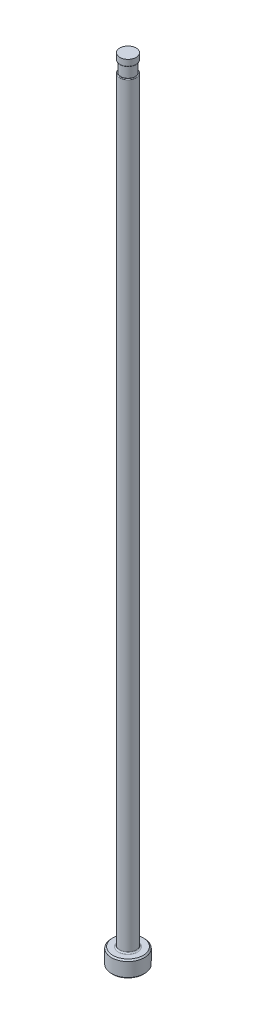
ISO-10303-21;
HEADER;
FILE_DESCRIPTION(('STEP AP214'),'2;1');
FILE_NAME('part.step','',(''),(''),'','','');
FILE_SCHEMA(('AUTOMOTIVE_DESIGN { 1 0 10303 214 1 1 1 1 }'));
ENDSEC;
DATA;
#1=APPLICATION_CONTEXT('core data for automotive mechanical design processes');
#2=APPLICATION_PROTOCOL_DEFINITION('international standard','automotive_design',2000,#1);
#3=PRODUCT_CONTEXT('',#1,'mechanical');
#4=PRODUCT('Part','Part','',(#3));
#5=PRODUCT_RELATED_PRODUCT_CATEGORY('part','',(#4));
#6=PRODUCT_DEFINITION_FORMATION('','',#4);
#7=PRODUCT_DEFINITION_CONTEXT('part definition',#1,'design');
#8=PRODUCT_DEFINITION('design','',#6,#7);
#9=PRODUCT_DEFINITION_SHAPE('','',#8);
#10=(LENGTH_UNIT() NAMED_UNIT(*) SI_UNIT(.MILLI.,.METRE.));
#11=(NAMED_UNIT(*) PLANE_ANGLE_UNIT() SI_UNIT($,.RADIAN.));
#12=(NAMED_UNIT(*) SI_UNIT($,.STERADIAN.) SOLID_ANGLE_UNIT());
#13=UNCERTAINTY_MEASURE_WITH_UNIT(LENGTH_MEASURE(1.E-05),#10,'distance_accuracy_value','');
#14=(GEOMETRIC_REPRESENTATION_CONTEXT(3) GLOBAL_UNCERTAINTY_ASSIGNED_CONTEXT((#13)) GLOBAL_UNIT_ASSIGNED_CONTEXT((#10,
#11,#12)) REPRESENTATION_CONTEXT('',''));
#15=CARTESIAN_POINT('',(0.,0.,0.));
#16=DIRECTION('',(0.,0.,1.));
#17=DIRECTION('',(1.,0.,0.));
#18=AXIS2_PLACEMENT_3D('',#15,#16,#17);
#19=CARTESIAN_POINT('',(-1.58749999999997,151.13,0.));
#20=DIRECTION('',(0.,1.,0.));
#21=DIRECTION('',(0.,0.,1.));
#22=AXIS2_PLACEMENT_3D('',#19,#20,#21);
#23=PLANE('',#22);
#24=CARTESIAN_POINT('',(0.,151.13,0.));
#25=DIRECTION('',(0.,1.,0.));
#26=DIRECTION('',(0.,0.,1.));
#27=AXIS2_PLACEMENT_3D('',#24,#25,#26);
#28=CIRCLE('',#27,1.44779999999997);
#29=CARTESIAN_POINT('',(0.,151.13,1.44779999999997));
#30=VERTEX_POINT('',#29);
#31=EDGE_CURVE('E11',#30,#30,#28,.F.);
#32=ORIENTED_EDGE('',*,*,#31,.T.);
#33=EDGE_LOOP('',(#32));
#34=FACE_BOUND('',#33,.T.);
#35=CARTESIAN_POINT('',(0.,151.13,0.));
#36=DIRECTION('',(0.,1.,0.));
#37=DIRECTION('',(0.,0.,1.));
#38=AXIS2_PLACEMENT_3D('',#35,#36,#37);
#39=CIRCLE('',#38,1.38429999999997);
#40=CARTESIAN_POINT('',(0.,151.13,1.38429999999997));
#41=VERTEX_POINT('',#40);
#42=EDGE_CURVE('E78',#41,#41,#39,.T.);
#43=ORIENTED_EDGE('',*,*,#42,.T.);
#44=EDGE_LOOP('',(#43));
#45=FACE_BOUND('',#44,.T.);
#46=ADVANCED_FACE('F36',(#34,#45),#23,.F.);
#47=CARTESIAN_POINT('',(0.,259.958771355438,0.));
#48=DIRECTION('',(0.,1.,0.));
#49=DIRECTION('',(0.,0.,1.));
#50=AXIS2_PLACEMENT_3D('',#47,#48,#49);
#51=CYLINDRICAL_SURFACE('',#50,1.58749999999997);
#52=DIRECTION('',(0.,1.,0.));
#53=VECTOR('',#52,1.);
#54=CARTESIAN_POINT('',(-1.38429999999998,259.958771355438,-0.777090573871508));
#55=LINE('',#54,#53);
#56=CARTESIAN_POINT('',(-1.38429999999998,148.971,-0.777090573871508));
#57=VERTEX_POINT('',#56);
#58=CARTESIAN_POINT('',(-1.38429999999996,86.614,-0.777090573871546));
#59=VERTEX_POINT('',#58);
#60=EDGE_CURVE('E73',#57,#59,#55,.F.);
#61=ORIENTED_EDGE('',*,*,#60,.F.);
#62=CARTESIAN_POINT('',(0.,148.971,0.));
#63=DIRECTION('',(0.,-1.,0.));
#64=DIRECTION('',(0.,0.,-1.));
#65=AXIS2_PLACEMENT_3D('',#62,#63,#64);
#66=CIRCLE('',#65,1.58749999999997);
#67=CARTESIAN_POINT('',(-1.38429999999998,148.971,0.777090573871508));
#68=VERTEX_POINT('',#67);
#69=EDGE_CURVE('E51',#57,#68,#66,.T.);
#70=ORIENTED_EDGE('',*,*,#69,.T.);
#71=DIRECTION('',(0.,1.,0.));
#72=VECTOR('',#71,1.);
#73=CARTESIAN_POINT('',(-1.38429999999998,259.958771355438,0.777090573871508));
#74=LINE('',#73,#72);
#75=CARTESIAN_POINT('',(-1.38429999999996,86.614,0.777090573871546));
#76=VERTEX_POINT('',#75);
#77=EDGE_CURVE('E84',#76,#68,#74,.T.);
#78=ORIENTED_EDGE('',*,*,#77,.F.);
#79=CARTESIAN_POINT('',(-1.38429999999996,86.614,-0.777090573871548));
#80=CARTESIAN_POINT('',(-1.38429609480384,86.5767272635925,-0.777082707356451));
#81=CARTESIAN_POINT('',(-1.38495631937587,86.5394527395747,-0.775921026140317));
#82=CARTESIAN_POINT('',(-1.38757712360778,86.4650763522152,-0.771232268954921));
#83=CARTESIAN_POINT('',(-1.38953849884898,86.4279746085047,-0.767703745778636));
#84=CARTESIAN_POINT('',(-1.39477495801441,86.3535790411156,-0.758148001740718));
#85=CARTESIAN_POINT('',(-1.39807044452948,86.316291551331,-0.752081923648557));
#86=CARTESIAN_POINT('',(-1.40590319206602,86.2423849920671,-0.737333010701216));
#87=CARTESIAN_POINT('',(-1.41044024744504,86.2057658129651,-0.728650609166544));
#88=CARTESIAN_POINT('',(-1.42582382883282,86.096986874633,-0.698367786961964));
#89=CARTESIAN_POINT('',(-1.43842338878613,86.0261687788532,-0.672562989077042));
#90=CARTESIAN_POINT('',(-1.46680838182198,85.8916572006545,-0.608160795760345));
#91=CARTESIAN_POINT('',(-1.48256997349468,85.8279156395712,-0.569657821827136));
#92=CARTESIAN_POINT('',(-1.50737283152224,85.7379333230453,-0.498685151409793));
#93=CARTESIAN_POINT('',(-1.51626333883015,85.7076802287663,-0.471232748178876));
#94=CARTESIAN_POINT('',(-1.53347485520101,85.6517865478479,-0.411785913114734));
#95=CARTESIAN_POINT('',(-1.54179640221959,85.6261415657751,-0.379795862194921));
#96=CARTESIAN_POINT('',(-1.55583338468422,85.5843277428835,-0.316871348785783));
#97=CARTESIAN_POINT('',(-1.56175286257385,85.5673042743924,-0.28655344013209));
#98=CARTESIAN_POINT('',(-1.57203785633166,85.53830135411,-0.223329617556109));
#99=CARTESIAN_POINT('',(-1.57640406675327,85.5263196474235,-0.190424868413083));
#100=CARTESIAN_POINT('',(-1.58312350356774,85.5080632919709,-0.122641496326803));
#101=CARTESIAN_POINT('',(-1.58546485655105,85.5018222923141,-0.0877524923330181));
#102=CARTESIAN_POINT('',(-1.58779523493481,85.4956097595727,-0.0173445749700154));
#103=CARTESIAN_POINT('',(-1.58778524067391,85.4956356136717,0.0181740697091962));
#104=CARTESIAN_POINT('',(-1.58553927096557,85.5016246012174,0.0850166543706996));
#105=CARTESIAN_POINT('',(-1.58352667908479,85.5069919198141,0.116403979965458));
#106=CARTESIAN_POINT('',(-1.57781194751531,85.5224774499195,0.177812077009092));
#107=CARTESIAN_POINT('',(-1.57410971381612,85.5325959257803,0.20783277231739));
#108=CARTESIAN_POINT('',(-1.56522233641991,85.5574483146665,0.266740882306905));
#109=CARTESIAN_POINT('',(-1.55999564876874,85.5723128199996,0.295566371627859));
#110=CARTESIAN_POINT('',(-1.54854541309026,85.6058843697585,0.350651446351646));
#111=CARTESIAN_POINT('',(-1.54232137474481,85.6245933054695,0.376909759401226));
#112=CARTESIAN_POINT('',(-1.52624085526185,85.674770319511,0.438380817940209));
#113=CARTESIAN_POINT('',(-1.51605337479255,85.7080994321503,0.471992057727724));
#114=CARTESIAN_POINT('',(-1.49561074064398,85.7798332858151,0.533246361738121));
#115=CARTESIAN_POINT('',(-1.48535548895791,85.8182487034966,0.560876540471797));
#116=CARTESIAN_POINT('',(-1.46194815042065,85.9138127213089,0.61985698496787));
#117=CARTESIAN_POINT('',(-1.44915247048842,85.9725828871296,0.648714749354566));
#118=CARTESIAN_POINT('',(-1.42648713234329,86.0944065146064,0.697138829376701));
#119=CARTESIAN_POINT('',(-1.41662511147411,86.1574706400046,0.716680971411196));
#120=CARTESIAN_POINT('',(-1.40064446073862,86.2858415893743,0.747428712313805));
#121=CARTESIAN_POINT('',(-1.39451475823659,86.3511411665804,0.758658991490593));
#122=CARTESIAN_POINT('',(-1.38838804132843,86.449622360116,0.769772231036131));
#123=CARTESIAN_POINT('',(-1.38685717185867,86.4824222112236,0.772521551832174));
#124=CARTESIAN_POINT('',(-1.38481284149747,86.5481449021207,0.776178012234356));
#125=CARTESIAN_POINT('',(-1.38429902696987,86.5810676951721,0.777085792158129));
#126=CARTESIAN_POINT('',(-1.38429999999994,86.6139999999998,0.777090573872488));
#127=B_SPLINE_CURVE_WITH_KNOTS('',3,(#79,#80,#81,#82,#83,#84,#85,#86,#87,#88,#89,#90,#91,#92,
#93,#94,#95,#96,#97,#98,#99,#100,#101,#102,#103,#104,#105,#106,#107,#108,#109,#110,#111,#112,
#113,#114,#115,#116,#117,#118,#119,#120,#121,#122,#123,#124,#125,#126),.UNSPECIFIED.,.F.,.F.,(4,
2,2,2,2,2,2,2,2,2,2,2,2,2,2,2,2,2,2,2,2,2,2,4),(0.,0.111796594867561,0.22366161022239,
0.33730621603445,0.450932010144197,0.678971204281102,0.905351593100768,1.03037322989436,
1.1552749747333,1.26065408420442,1.36598601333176,1.47193148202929,1.57783277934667,
1.67311136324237,1.76839524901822,1.86656705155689,1.96478726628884,2.10923104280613,
2.25398297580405,2.45303424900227,2.65259927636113,2.85156933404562,2.95036438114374,
3.04912507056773),.UNSPECIFIED.);
#128=EDGE_CURVE('E81',#59,#76,#127,.T.);
#129=ORIENTED_EDGE('',*,*,#128,.F.);
#130=EDGE_LOOP('',(#61,#70,#78,#129));
#131=FACE_BOUND('',#130,.T.);
#132=CARTESIAN_POINT('',(0.,3.42900000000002,0.));
#133=DIRECTION('',(0.,1.,0.));
#134=DIRECTION('',(0.,0.,1.));
#135=AXIS2_PLACEMENT_3D('',#132,#133,#134);
#136=CIRCLE('',#135,1.58749999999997);
#137=CARTESIAN_POINT('',(0.,3.42900000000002,1.58749999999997));
#138=VERTEX_POINT('',#137);
#139=EDGE_CURVE('E116',#138,#138,#136,.T.);
#140=ORIENTED_EDGE('',*,*,#139,.T.);
#141=EDGE_LOOP('',(#140));
#142=FACE_BOUND('',#141,.T.);
#143=ADVANCED_FACE('F82',(#131,#142),#51,.T.);
#144=CARTESIAN_POINT('',(0.,0.,0.));
#145=DIRECTION('',(0.,-1.,0.));
#146=DIRECTION('',(0.,0.,-1.));
#147=AXIS2_PLACEMENT_3D('',#144,#145,#146);
#148=PLANE('',#147);
#149=CARTESIAN_POINT('',(0.,0.,0.));
#150=DIRECTION('',(0.,-1.,0.));
#151=DIRECTION('',(0.,0.,-1.));
#152=AXIS2_PLACEMENT_3D('',#149,#150,#151);
#153=CIRCLE('',#152,2.92099999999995);
#154=CARTESIAN_POINT('',(0.,0.,-2.92099999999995));
#155=VERTEX_POINT('',#154);
#156=EDGE_CURVE('E113',#155,#155,#153,.T.);
#157=ORIENTED_EDGE('',*,*,#156,.T.);
#158=EDGE_LOOP('',(#157));
#159=FACE_BOUND('',#158,.T.);
#160=ADVANCED_FACE('F192',(#159),#148,.T.);
#161=CARTESIAN_POINT('',(0.,259.958771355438,0.));
#162=DIRECTION('',(0.,1.,0.));
#163=DIRECTION('',(0.,0.,1.));
#164=AXIS2_PLACEMENT_3D('',#161,#162,#163);
#165=CYLINDRICAL_SURFACE('',#164,3.17499999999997);
#166=CARTESIAN_POINT('',(0.,2.92100000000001,0.));
#167=DIRECTION('',(0.,1.,0.));
#168=DIRECTION('',(0.,0.,1.));
#169=AXIS2_PLACEMENT_3D('',#166,#167,#168);
#170=CIRCLE('',#169,3.17499999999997);
#171=CARTESIAN_POINT('',(0.,2.92100000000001,3.17499999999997));
#172=VERTEX_POINT('',#171);
#173=EDGE_CURVE('E110',#172,#172,#170,.F.);
#174=ORIENTED_EDGE('',*,*,#173,.T.);
#175=EDGE_LOOP('',(#174));
#176=FACE_BOUND('',#175,.T.);
#177=CARTESIAN_POINT('',(0.,0.254000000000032,0.));
#178=DIRECTION('',(0.,-1.,0.));
#179=DIRECTION('',(0.,0.,-1.));
#180=AXIS2_PLACEMENT_3D('',#177,#178,#179);
#181=CIRCLE('',#180,3.17499999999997);
#182=CARTESIAN_POINT('',(0.,0.254000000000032,-3.17499999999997));
#183=VERTEX_POINT('',#182);
#184=EDGE_CURVE('E107',#183,#183,#181,.F.);
#185=ORIENTED_EDGE('',*,*,#184,.T.);
#186=EDGE_LOOP('',(#185));
#187=FACE_BOUND('',#186,.T.);
#188=ADVANCED_FACE('F195',(#176,#187),#165,.T.);
#189=CARTESIAN_POINT('',(-3.17499999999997,3.175,0.));
#190=DIRECTION('',(0.,1.,0.));
#191=DIRECTION('',(0.,0.,1.));
#192=AXIS2_PLACEMENT_3D('',#189,#190,#191);
#193=PLANE('',#192);
#194=CARTESIAN_POINT('',(0.,3.175,0.));
#195=DIRECTION('',(0.,1.,0.));
#196=DIRECTION('',(0.,0.,1.));
#197=AXIS2_PLACEMENT_3D('',#194,#195,#196);
#198=CIRCLE('',#197,1.84149999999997);
#199=CARTESIAN_POINT('',(0.,3.175,1.84149999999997));
#200=VERTEX_POINT('',#199);
#201=EDGE_CURVE('E87',#200,#200,#198,.F.);
#202=ORIENTED_EDGE('',*,*,#201,.T.);
#203=EDGE_LOOP('',(#202));
#204=FACE_BOUND('',#203,.T.);
#205=CARTESIAN_POINT('',(0.,3.175,0.));
#206=DIRECTION('',(0.,1.,0.));
#207=DIRECTION('',(0.,0.,1.));
#208=AXIS2_PLACEMENT_3D('',#205,#206,#207);
#209=CIRCLE('',#208,2.92099999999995);
#210=CARTESIAN_POINT('',(0.,3.175,2.92099999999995));
#211=VERTEX_POINT('',#210);
#212=EDGE_CURVE('E104',#211,#211,#209,.T.);
#213=ORIENTED_EDGE('',*,*,#212,.T.);
#214=EDGE_LOOP('',(#213));
#215=FACE_BOUND('',#214,.T.);
#216=ADVANCED_FACE('F190',(#204,#215),#193,.T.);
#217=CARTESIAN_POINT('',(0.,3.17499999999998,0.));
#218=DIRECTION('',(0.,-1.,0.));
#219=DIRECTION('',(0.,0.,-1.));
#220=AXIS2_PLACEMENT_3D('',#217,#218,#219);
#221=CONICAL_SURFACE('',#220,2.92099999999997,0.7853981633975);
#222=ORIENTED_EDGE('',*,*,#173,.F.);
#223=EDGE_LOOP('',(#222));
#224=FACE_BOUND('',#223,.T.);
#225=ORIENTED_EDGE('',*,*,#212,.F.);
#226=EDGE_LOOP('',(#225));
#227=FACE_BOUND('',#226,.T.);
#228=ADVANCED_FACE('F186',(#224,#227),#221,.T.);
#229=CARTESIAN_POINT('',(0.,0.254000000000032,0.));
#230=DIRECTION('',(0.,1.,0.));
#231=DIRECTION('',(0.,0.,1.));
#232=AXIS2_PLACEMENT_3D('',#229,#230,#231);
#233=CONICAL_SURFACE('',#232,3.17499999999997,0.785398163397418);
#234=ORIENTED_EDGE('',*,*,#156,.F.);
#235=EDGE_LOOP('',(#234));
#236=FACE_BOUND('',#235,.T.);
#237=ORIENTED_EDGE('',*,*,#184,.F.);
#238=EDGE_LOOP('',(#237));
#239=FACE_BOUND('',#238,.T.);
#240=ADVANCED_FACE('F182',(#236,#239),#233,.T.);
#241=CARTESIAN_POINT('',(0.,3.42900000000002,0.));
#242=DIRECTION('',(0.,1.,0.));
#243=DIRECTION('',(0.,0.,1.));
#244=AXIS2_PLACEMENT_3D('',#241,#242,#243);
#245=TOROIDAL_SURFACE('',#244,1.84149999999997,0.254);
#246=ORIENTED_EDGE('',*,*,#201,.F.);
#247=EDGE_LOOP('',(#246));
#248=FACE_BOUND('',#247,.T.);
#249=ORIENTED_EDGE('',*,*,#139,.F.);
#250=EDGE_LOOP('',(#249));
#251=FACE_BOUND('',#250,.T.);
#252=ADVANCED_FACE('F147',(#248,#251),#245,.F.);
#253=CARTESIAN_POINT('',(-1.58749999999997,149.098,0.));
#254=DIRECTION('',(0.,-1.,0.));
#255=DIRECTION('',(0.,0.,-1.));
#256=AXIS2_PLACEMENT_3D('',#253,#254,#255);
#257=PLANE('',#256);
#258=DIRECTION('',(0.,0.,1.));
#259=VECTOR('',#258,1.);
#260=CARTESIAN_POINT('',(-1.38429999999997,149.098,0.));
#261=LINE('',#260,#259);
#262=CARTESIAN_POINT('',(-1.38429999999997,149.098,0.));
#263=VERTEX_POINT('',#262);
#264=CARTESIAN_POINT('',(-1.38429999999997,149.098,0.465589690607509));
#265=VERTEX_POINT('',#264);
#266=EDGE_CURVE('E90',#263,#265,#261,.T.);
#267=ORIENTED_EDGE('',*,*,#266,.T.);
#268=CARTESIAN_POINT('',(0.,149.098,0.));
#269=DIRECTION('',(0.,-1.,0.));
#270=DIRECTION('',(0.,0.,-1.));
#271=AXIS2_PLACEMENT_3D('',#268,#269,#270);
#272=CIRCLE('',#271,1.46049999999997);
#273=CARTESIAN_POINT('',(-1.38429999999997,149.098,-0.465589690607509));
#274=VERTEX_POINT('',#273);
#275=EDGE_CURVE('E86',#265,#274,#272,.F.);
#276=ORIENTED_EDGE('',*,*,#275,.T.);
#277=EDGE_CURVE('E79',#274,#263,#261,.T.);
#278=ORIENTED_EDGE('',*,*,#277,.T.);
#279=CARTESIAN_POINT('',(0.,149.098,0.));
#280=DIRECTION('',(0.,1.,0.));
#281=DIRECTION('',(0.,0.,1.));
#282=AXIS2_PLACEMENT_3D('',#279,#280,#281);
#283=CIRCLE('',#282,1.38429999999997);
#284=EDGE_CURVE('E101',#263,#263,#283,.T.);
#285=ORIENTED_EDGE('',*,*,#284,.F.);
#286=EDGE_LOOP('',(#267,#276,#278,#285));
#287=FACE_BOUND('',#286,.T.);
#288=ADVANCED_FACE('F144',(#287),#257,.F.);
#289=CARTESIAN_POINT('',(0.,153.448281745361,0.));
#290=DIRECTION('',(0.,1.,0.));
#291=DIRECTION('',(0.,0.,1.));
#292=AXIS2_PLACEMENT_3D('',#289,#290,#291);
#293=CYLINDRICAL_SURFACE('',#292,1.38429999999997);
#294=ORIENTED_EDGE('',*,*,#42,.F.);
#295=EDGE_LOOP('',(#294));
#296=FACE_BOUND('',#295,.T.);
#297=ORIENTED_EDGE('',*,*,#284,.T.);
#298=EDGE_LOOP('',(#297));
#299=FACE_BOUND('',#298,.T.);
#300=ADVANCED_FACE('F141',(#296,#299),#293,.T.);
#301=CARTESIAN_POINT('',(-1.38429999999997,150.114,-3.17499999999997));
#302=DIRECTION('',(1.,0.,0.));
#303=DIRECTION('',(0.,1.,0.));
#304=AXIS2_PLACEMENT_3D('',#301,#302,#303);
#305=PLANE('',#304);
#306=ORIENTED_EDGE('',*,*,#277,.F.);
#307=CARTESIAN_POINT('',(-1.38429999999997,149.098,-0.465589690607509));
#308=CARTESIAN_POINT('',(-1.38429999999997,149.097994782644,-0.479559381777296));
#309=CARTESIAN_POINT('',(-1.38429999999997,149.097765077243,-0.493535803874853));
#310=CARTESIAN_POINT('',(-1.38429999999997,149.096708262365,-0.521508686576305));
#311=CARTESIAN_POINT('',(-1.38429999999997,149.095879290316,-0.535505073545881));
#312=CARTESIAN_POINT('',(-1.38429999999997,149.093476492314,-0.563404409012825));
#313=CARTESIAN_POINT('',(-1.38429999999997,149.091904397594,-0.577307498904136));
#314=CARTESIAN_POINT('',(-1.38429999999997,149.087817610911,-0.604962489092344));
#315=CARTESIAN_POINT('',(-1.38429999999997,149.085304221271,-0.618714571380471));
#316=CARTESIAN_POINT('',(-1.38429999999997,149.080078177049,-0.641494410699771));
#317=CARTESIAN_POINT('',(-1.38429999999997,149.077698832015,-0.650597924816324));
#318=CARTESIAN_POINT('',(-1.38429999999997,149.072254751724,-0.668645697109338));
#319=CARTESIAN_POINT('',(-1.38429999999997,149.069187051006,-0.677589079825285));
#320=CARTESIAN_POINT('',(-1.38429999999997,149.061185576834,-0.697758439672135));
#321=CARTESIAN_POINT('',(-1.38429999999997,149.055968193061,-0.708874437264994));
#322=CARTESIAN_POINT('',(-1.38429999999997,149.04365165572,-0.730002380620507));
#323=CARTESIAN_POINT('',(-1.38429999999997,149.036567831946,-0.740022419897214));
#324=CARTESIAN_POINT('',(-1.38429999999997,149.02508447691,-0.752196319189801));
#325=CARTESIAN_POINT('',(-1.38429999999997,149.021763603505,-0.75536058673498));
#326=CARTESIAN_POINT('',(-1.38429999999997,149.014727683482,-0.761230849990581));
#327=CARTESIAN_POINT('',(-1.38429999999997,149.011012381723,-0.763936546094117));
#328=CARTESIAN_POINT('',(-1.38429999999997,149.003139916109,-0.768755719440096));
#329=CARTESIAN_POINT('',(-1.38429999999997,148.998977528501,-0.770860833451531));
#330=CARTESIAN_POINT('',(-1.38429999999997,148.990327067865,-0.774221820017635));
#331=CARTESIAN_POINT('',(-1.38429999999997,148.985840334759,-0.775480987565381));
#332=CARTESIAN_POINT('',(-1.38429999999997,148.97957988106,-0.77652141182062));
#333=CARTESIAN_POINT('',(-1.38429999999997,148.977871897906,-0.776734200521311));
#334=CARTESIAN_POINT('',(-1.38429999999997,148.974442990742,-0.777018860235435));
#335=CARTESIAN_POINT('',(-1.38429999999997,148.972722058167,-0.77709062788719));
#336=CARTESIAN_POINT('',(-1.38429999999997,148.971,-0.777090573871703));
#337=B_SPLINE_CURVE_WITH_KNOTS('',3,(#307,#308,#309,#310,#311,#312,#313,#314,#315,#316,#317,
#318,#319,#320,#321,#322,#323,#324,#325,#326,#327,#328,#329,#330,#331,#332,#333,#334,#335,#336),
.UNSPECIFIED.,.F.,.F.,(4,2,2,2,2,2,2,2,2,2,2,2,2,2,4),(0.,0.0419176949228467,0.0839662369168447,
0.125917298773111,0.167810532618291,0.196018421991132,0.224350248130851,0.261087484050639,
0.29753191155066,0.311262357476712,0.325001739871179,0.338924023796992,0.352791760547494,
0.357950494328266,0.363113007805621),.UNSPECIFIED.);
#338=EDGE_CURVE('E59',#274,#57,#337,.T.);
#339=ORIENTED_EDGE('',*,*,#338,.T.);
#340=ORIENTED_EDGE('',*,*,#60,.T.);
#341=DIRECTION('',(0.,0.,1.));
#342=VECTOR('',#341,1.);
#343=CARTESIAN_POINT('',(-1.38429999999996,86.614,-3.17499999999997));
#344=LINE('',#343,#342);
#345=EDGE_CURVE('E77',#59,#76,#344,.T.);
#346=ORIENTED_EDGE('',*,*,#345,.T.);
#347=ORIENTED_EDGE('',*,*,#77,.T.);
#348=CARTESIAN_POINT('',(-1.38429999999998,148.971,0.777090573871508));
#349=CARTESIAN_POINT('',(-1.38429999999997,148.974750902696,0.777099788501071));
#350=CARTESIAN_POINT('',(-1.38429999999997,148.9784915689,0.776751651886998));
#351=CARTESIAN_POINT('',(-1.38429999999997,148.985825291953,0.775421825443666));
#352=CARTESIAN_POINT('',(-1.38429999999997,148.989419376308,0.774445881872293));
#353=CARTESIAN_POINT('',(-1.38429999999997,148.996393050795,0.771942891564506));
#354=CARTESIAN_POINT('',(-1.38429999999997,148.999773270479,0.770417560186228));
#355=CARTESIAN_POINT('',(-1.38429999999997,149.006296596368,0.766915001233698));
#356=CARTESIAN_POINT('',(-1.38429999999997,149.00943911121,0.764936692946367));
#357=CARTESIAN_POINT('',(-1.38429999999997,149.017606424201,0.759093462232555));
#358=CARTESIAN_POINT('',(-1.38429999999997,149.022385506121,0.754885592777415));
#359=CARTESIAN_POINT('',(-1.38429999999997,149.031244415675,0.745791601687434));
#360=CARTESIAN_POINT('',(-1.38429999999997,149.035322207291,0.740903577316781));
#361=CARTESIAN_POINT('',(-1.38429999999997,149.045805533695,0.726719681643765));
#362=CARTESIAN_POINT('',(-1.38429999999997,149.051560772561,0.71694762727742));
#363=CARTESIAN_POINT('',(-1.38429999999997,149.061646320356,0.696707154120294));
#364=CARTESIAN_POINT('',(-1.38429999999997,149.065972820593,0.686236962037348));
#365=CARTESIAN_POINT('',(-1.38429999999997,149.074704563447,0.661619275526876));
#366=CARTESIAN_POINT('',(-1.38429999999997,149.078720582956,0.647335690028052));
#367=CARTESIAN_POINT('',(-1.38429999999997,149.085382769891,0.618445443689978));
#368=CARTESIAN_POINT('',(-1.38429999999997,149.08802632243,0.603838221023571));
#369=CARTESIAN_POINT('',(-1.38429999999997,149.094406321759,0.559733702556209));
#370=CARTESIAN_POINT('',(-1.38429999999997,149.096575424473,0.530010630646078));
#371=CARTESIAN_POINT('',(-1.38429999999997,149.097661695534,0.494502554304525));
#372=CARTESIAN_POINT('',(-1.38429999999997,149.097791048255,0.488707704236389));
#373=CARTESIAN_POINT('',(-1.38429999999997,149.097960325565,0.477139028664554));
#374=CARTESIAN_POINT('',(-1.38429999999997,149.098000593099,0.471365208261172));
#375=CARTESIAN_POINT('',(-1.38429999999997,149.098,0.465589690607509));
#376=B_SPLINE_CURVE_WITH_KNOTS('',3,(#348,#349,#350,#351,#352,#353,#354,#355,#356,#357,#358,
#359,#360,#361,#362,#363,#364,#365,#366,#367,#368,#369,#370,#371,#372,#373,#374,#375),
.UNSPECIFIED.,.F.,.F.,(4,2,2,2,2,2,2,2,2,2,2,2,2,4),(0.,0.0112203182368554,0.0223393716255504,
0.0334240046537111,0.0445353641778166,0.0635271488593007,0.0825731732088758,0.116404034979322,
0.150324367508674,0.194732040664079,0.239224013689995,0.328384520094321,0.345774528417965,
0.36309747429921),.UNSPECIFIED.);
#377=EDGE_CURVE('E172',#68,#265,#376,.T.);
#378=ORIENTED_EDGE('',*,*,#377,.T.);
#379=ORIENTED_EDGE('',*,*,#266,.F.);
#380=EDGE_LOOP('',(#306,#339,#340,#346,#347,#378,#379));
#381=FACE_BOUND('',#380,.T.);
#382=ADVANCED_FACE('F75',(#381),#305,.F.);
#383=CARTESIAN_POINT('',(-4.55929999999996,86.614,-3.17499999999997));
#384=DIRECTION('',(0.,0.,1.));
#385=DIRECTION('',(1.,0.,0.));
#386=AXIS2_PLACEMENT_3D('',#383,#384,#385);
#387=CYLINDRICAL_SURFACE('',#386,3.175);
#388=ORIENTED_EDGE('',*,*,#345,.F.);
#389=ORIENTED_EDGE('',*,*,#128,.T.);
#390=EDGE_LOOP('',(#388,#389));
#391=FACE_BOUND('',#390,.T.);
#392=ADVANCED_FACE('F89',(#391),#387,.F.);
#393=CARTESIAN_POINT('',(0.,152.687735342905,0.));
#394=DIRECTION('',(0.,1.,0.));
#395=DIRECTION('',(0.,0.,1.));
#396=AXIS2_PLACEMENT_3D('',#393,#394,#395);
#397=CYLINDRICAL_SURFACE('',#396,1.57479999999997);
#398=CARTESIAN_POINT('',(0.,151.257,0.));
#399=DIRECTION('',(0.,1.,0.));
#400=DIRECTION('',(0.,0.,1.));
#401=AXIS2_PLACEMENT_3D('',#398,#399,#400);
#402=CIRCLE('',#401,1.57479999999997);
#403=CARTESIAN_POINT('',(0.,151.257,1.57479999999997));
#404=VERTEX_POINT('',#403);
#405=EDGE_CURVE('E44',#404,#404,#402,.T.);
#406=ORIENTED_EDGE('',*,*,#405,.T.);
#407=EDGE_LOOP('',(#406));
#408=FACE_BOUND('',#407,.T.);
#409=CARTESIAN_POINT('',(0.,152.4,0.));
#410=DIRECTION('',(0.,1.,0.));
#411=DIRECTION('',(0.,0.,1.));
#412=AXIS2_PLACEMENT_3D('',#409,#410,#411);
#413=CIRCLE('',#412,1.57479999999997);
#414=CARTESIAN_POINT('',(0.,152.4,1.57479999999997));
#415=VERTEX_POINT('',#414);
#416=EDGE_CURVE('E91',#415,#415,#413,.T.);
#417=ORIENTED_EDGE('',*,*,#416,.F.);
#418=EDGE_LOOP('',(#417));
#419=FACE_BOUND('',#418,.T.);
#420=ADVANCED_FACE('F135',(#408,#419),#397,.T.);
#421=CARTESIAN_POINT('',(-1.58749999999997,152.4,0.));
#422=DIRECTION('',(0.,1.,0.));
#423=DIRECTION('',(0.,0.,1.));
#424=AXIS2_PLACEMENT_3D('',#421,#422,#423);
#425=PLANE('',#424);
#426=ORIENTED_EDGE('',*,*,#416,.T.);
#427=EDGE_LOOP('',(#426));
#428=FACE_BOUND('',#427,.T.);
#429=ADVANCED_FACE('F149',(#428),#425,.T.);
#430=CARTESIAN_POINT('',(0.,148.971,0.));
#431=DIRECTION('',(0.,-1.,0.));
#432=DIRECTION('',(0.,0.,-1.));
#433=AXIS2_PLACEMENT_3D('',#430,#431,#432);
#434=TOROIDAL_SURFACE('',#433,1.46049999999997,0.127);
#435=ORIENTED_EDGE('',*,*,#377,.F.);
#436=ORIENTED_EDGE('',*,*,#69,.F.);
#437=ORIENTED_EDGE('',*,*,#338,.F.);
#438=ORIENTED_EDGE('',*,*,#275,.F.);
#439=EDGE_LOOP('',(#435,#436,#437,#438));
#440=FACE_BOUND('',#439,.T.);
#441=ADVANCED_FACE('F151',(#440),#434,.T.);
#442=CARTESIAN_POINT('',(0.,151.257,0.));
#443=DIRECTION('',(0.,1.,0.));
#444=DIRECTION('',(0.,0.,1.));
#445=AXIS2_PLACEMENT_3D('',#442,#443,#444);
#446=TOROIDAL_SURFACE('',#445,1.44779999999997,0.127);
#447=ORIENTED_EDGE('',*,*,#31,.F.);
#448=EDGE_LOOP('',(#447));
#449=FACE_BOUND('',#448,.T.);
#450=ORIENTED_EDGE('',*,*,#405,.F.);
#451=EDGE_LOOP('',(#450));
#452=FACE_BOUND('',#451,.T.);
#453=ADVANCED_FACE('F38',(#449,#452),#446,.T.);
#454=CLOSED_SHELL('',(#46,#143,#160,#188,#216,#228,#240,#252,#288,#300,#382,#392,#420,#429,#441,#453));
#455=MANIFOLD_SOLID_BREP('B2',#454);
#456=ADVANCED_BREP_SHAPE_REPRESENTATION('',(#18,#455),#14);
#457=SHAPE_DEFINITION_REPRESENTATION(#9,#456);
ENDSEC;
END-ISO-10303-21;
